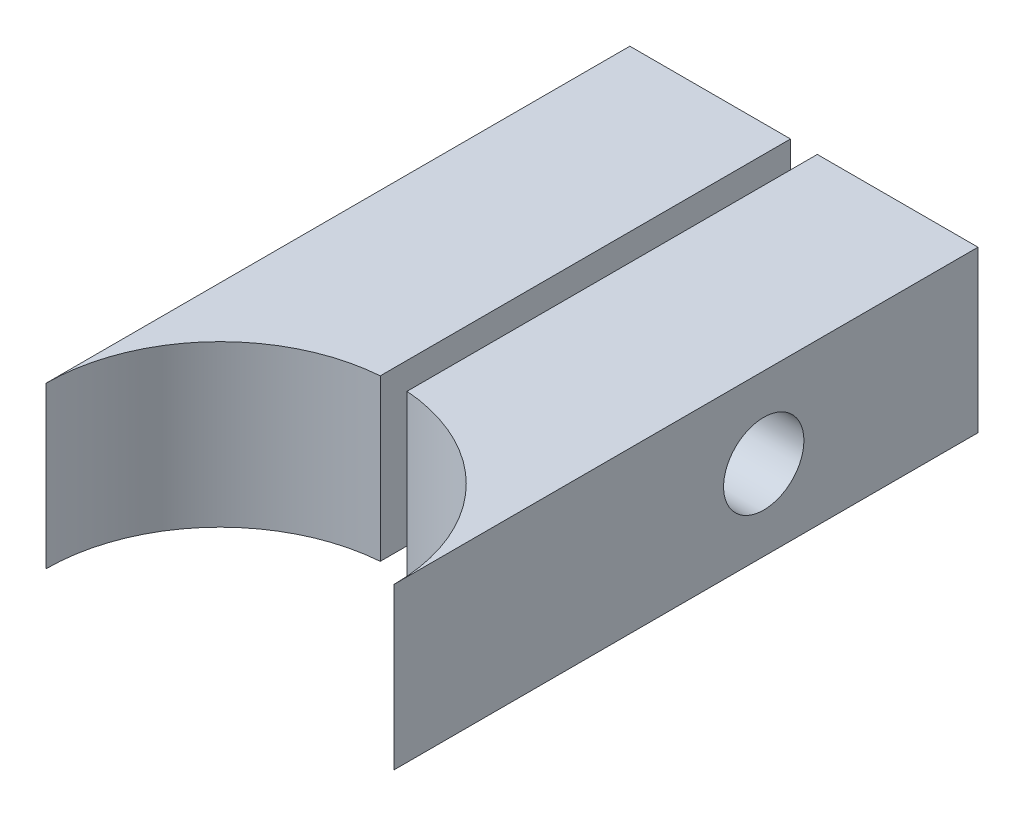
from build123d import *

# Parameters (mm, degrees)
EXTRUDE_1_DEPTH     = 6
EXTRUDE_1_2_DEPTH   = 6
SKETCH_2_R          = 1.5
CUT_EXTRUDE_1_DEPTH = 15


with BuildPart() as part:
    # Sketch 1 → Extrude 1 (new body)
    with BuildSketch(Plane(origin=(0, 0, 0), x_dir=(1, 0, 0), z_dir=(0, 1, 0))):
        with BuildLine():
            Line((14.028856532, -21.164313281), (14.028856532, 0.635456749))
            Line((14.028856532, 0.635456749), (20.028856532, 0.635456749))
            Line((20.028856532, 0.635456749), (20.028856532, -14.683572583))
            ThreePointArc((20.028856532, -14.683572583), (15.759160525, -16.748432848), (14.028856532, -21.164313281))
        make_face()
    extrude(amount=EXTRUDE_1_DEPTH)


with BuildPart() as body_2:
    # Sketch 1 → Extrude 1 2 (new body)
    with BuildSketch(Plane(origin=(0, 0, 0), x_dir=(1, 0, 0), z_dir=(0, 1, 0))):
        with BuildLine():
            Line((27.028856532, -21.164313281), (27.028856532, 0.635456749))
            Line((27.028856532, 0.635456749), (21.028856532, 0.635456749))
            Line((21.028856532, 0.635456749), (21.028856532, -14.683572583))
            ThreePointArc((21.028856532, -14.683572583), (25.298552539, -16.748432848), (27.028856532, -21.164313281))
        make_face()
    extrude(amount=EXTRUDE_1_2_DEPTH)


with BuildPart() as cut_extrude_1_tool:
    # Sketch 2 → Cut-Extrude 1 (new body)
    with BuildSketch(Plane(origin=(27.028856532, 0, 0), x_dir=(0, 0, -1), z_dir=(1, 0, 0))):
        with Locations((-7.364543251, 3)):
            Circle(SKETCH_2_R)
    extrude(amount=-CUT_EXTRUDE_1_DEPTH)


with BuildPart() as part_1:
    add(part.part)

    # Cut-Extrude 1: cut by cut_extrude_1_tool
    add(cut_extrude_1_tool.part, mode=Mode.SUBTRACT)


with BuildPart() as body_2_1:
    add(body_2.part)

    # Cut-Extrude 1: cut by cut_extrude_1_tool
    add(cut_extrude_1_tool.part, mode=Mode.SUBTRACT)


solid = Compound([part_1.part, body_2_1.part])
